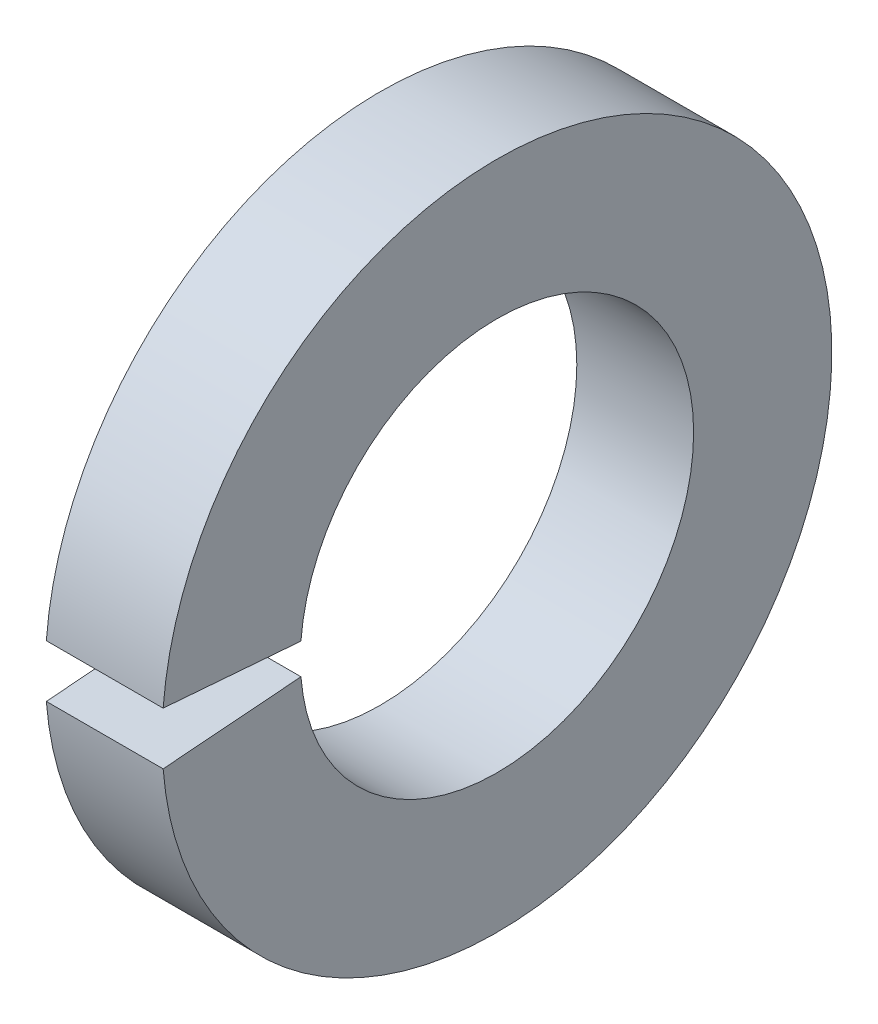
from build123d import *

# Parameters (mm, degrees)
SKETCH1_W = 6
SKETCH1_H = 7.1
GAP_DEPTH = 26.053542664


with BuildPart() as part:
    # Sketch1 → Base-Revolve (revolve)
    with BuildSketch(Plane.XY, mode=Mode.PRIVATE) as base_revolve_sk:
        with Locations((-3, 13.65)):
            Rectangle(SKETCH1_W, SKETCH1_H)
    revolve(base_revolve_sk.sketch.rotate(Axis((-34.925, 0, 0), (1, 0, 0)), 90), axis=Axis((-34.925, 0, 0), (1, 0, 0)))

    # Sketch2 → Gap (cut, through all)
    with BuildSketch(Plane(origin=(0, 0, 0), x_dir=(0, -1, 0), z_dir=(-1, 0, 0))):
        with BuildLine():
            Line((0, 0), (1.376486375, 17.489917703))
            ThreePointArc((1.376486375, 17.489917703), (0, 17.544), (-1.376486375, 17.489917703))
            Line((-1.376486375, 17.489917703), (0, 0))
        make_face()
    extrude(amount=GAP_DEPTH, mode=Mode.SUBTRACT)


solid = part.part
